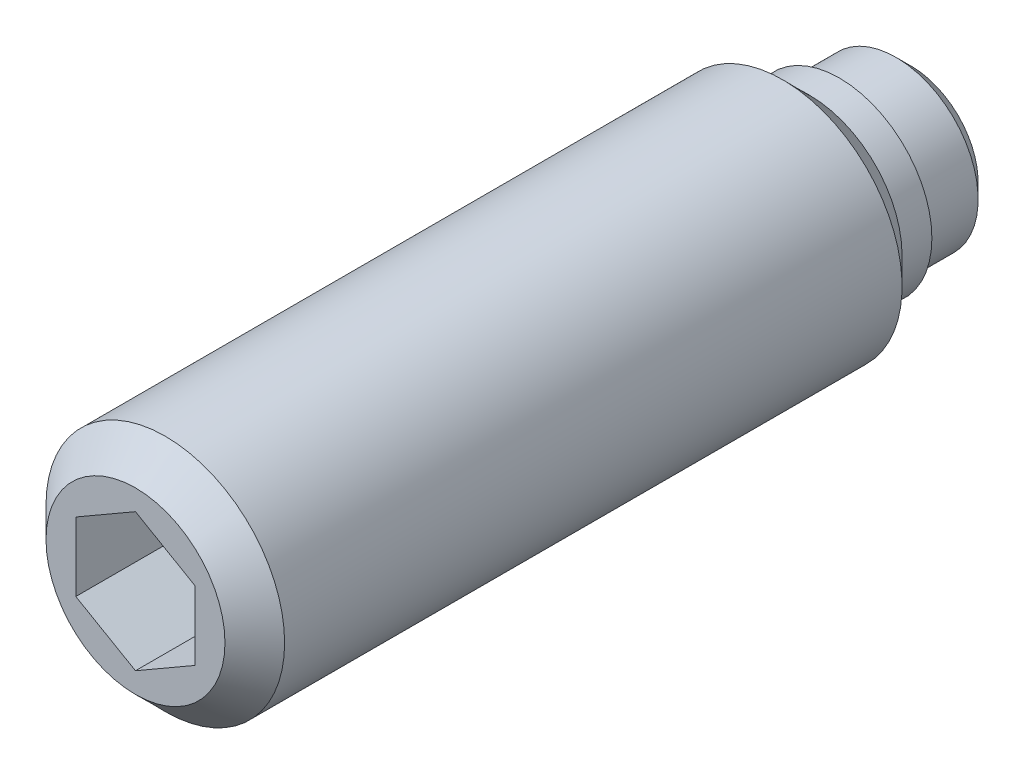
ISO-10303-21;
HEADER;
FILE_DESCRIPTION(('STEP AP214'),'2;1');
FILE_NAME('part.step','',(''),(''),'','','');
FILE_SCHEMA(('AUTOMOTIVE_DESIGN { 1 0 10303 214 1 1 1 1 }'));
ENDSEC;
DATA;
#1=APPLICATION_CONTEXT('core data for automotive mechanical design processes');
#2=APPLICATION_PROTOCOL_DEFINITION('international standard','automotive_design',2000,#1);
#3=PRODUCT_CONTEXT('',#1,'mechanical');
#4=PRODUCT('Part','Part','',(#3));
#5=PRODUCT_RELATED_PRODUCT_CATEGORY('part','',(#4));
#6=PRODUCT_DEFINITION_FORMATION('','',#4);
#7=PRODUCT_DEFINITION_CONTEXT('part definition',#1,'design');
#8=PRODUCT_DEFINITION('design','',#6,#7);
#9=PRODUCT_DEFINITION_SHAPE('','',#8);
#10=(LENGTH_UNIT() NAMED_UNIT(*) SI_UNIT(.MILLI.,.METRE.));
#11=(NAMED_UNIT(*) PLANE_ANGLE_UNIT() SI_UNIT($,.RADIAN.));
#12=(NAMED_UNIT(*) SI_UNIT($,.STERADIAN.) SOLID_ANGLE_UNIT());
#13=UNCERTAINTY_MEASURE_WITH_UNIT(LENGTH_MEASURE(1.E-05),#10,'distance_accuracy_value','');
#14=(GEOMETRIC_REPRESENTATION_CONTEXT(3) GLOBAL_UNCERTAINTY_ASSIGNED_CONTEXT((#13)) GLOBAL_UNIT_ASSIGNED_CONTEXT((#10,
#11,#12)) REPRESENTATION_CONTEXT('',''));
#15=CARTESIAN_POINT('',(0.,0.,0.));
#16=DIRECTION('',(0.,0.,1.));
#17=DIRECTION('',(1.,0.,0.));
#18=AXIS2_PLACEMENT_3D('',#15,#16,#17);
#19=CARTESIAN_POINT('',(0.,0.,2.4));
#20=DIRECTION('',(0.,0.,-1.));
#21=DIRECTION('',(-1.,0.,0.));
#22=AXIS2_PLACEMENT_3D('',#19,#20,#21);
#23=CYLINDRICAL_SURFACE('',#22,4.);
#24=CARTESIAN_POINT('',(0.,0.,25.));
#25=DIRECTION('',(0.,0.,1.));
#26=DIRECTION('',(1.,0.,0.));
#27=AXIS2_PLACEMENT_3D('',#24,#25,#26);
#28=CIRCLE('',#27,4.);
#29=CARTESIAN_POINT('',(4.,0.,25.));
#30=VERTEX_POINT('',#29);
#31=EDGE_CURVE('E9',#30,#30,#28,.F.);
#32=ORIENTED_EDGE('',*,*,#31,.T.);
#33=EDGE_LOOP('',(#32));
#34=FACE_BOUND('',#33,.T.);
#35=CARTESIAN_POINT('',(0.,0.,4.3));
#36=DIRECTION('',(0.,0.,-1.));
#37=DIRECTION('',(-1.,0.,0.));
#38=AXIS2_PLACEMENT_3D('',#35,#36,#37);
#39=CIRCLE('',#38,4.);
#40=CARTESIAN_POINT('',(-4.,0.,4.3));
#41=VERTEX_POINT('',#40);
#42=EDGE_CURVE('E74',#41,#41,#39,.T.);
#43=ORIENTED_EDGE('',*,*,#42,.F.);
#44=EDGE_LOOP('',(#43));
#45=FACE_BOUND('',#44,.T.);
#46=ADVANCED_FACE('F14',(#34,#45),#23,.T.);
#47=CARTESIAN_POINT('',(0.,0.,4.3));
#48=DIRECTION('',(0.,0.,1.));
#49=DIRECTION('',(1.,0.,0.));
#50=AXIS2_PLACEMENT_3D('',#47,#48,#49);
#51=CONICAL_SURFACE('',#50,4.,0.785398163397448);
#52=ORIENTED_EDGE('',*,*,#42,.T.);
#53=EDGE_LOOP('',(#52));
#54=FACE_BOUND('',#53,.T.);
#55=CARTESIAN_POINT('',(0.,0.,3.4));
#56=DIRECTION('',(0.,0.,-1.));
#57=DIRECTION('',(-1.,0.,0.));
#58=AXIS2_PLACEMENT_3D('',#55,#56,#57);
#59=CIRCLE('',#58,3.1);
#60=CARTESIAN_POINT('',(-3.1,0.,3.4));
#61=VERTEX_POINT('',#60);
#62=EDGE_CURVE('E112',#61,#61,#59,.T.);
#63=ORIENTED_EDGE('',*,*,#62,.F.);
#64=EDGE_LOOP('',(#63));
#65=FACE_BOUND('',#64,.T.);
#66=ADVANCED_FACE('F130',(#54,#65),#51,.T.);
#67=CARTESIAN_POINT('',(0.,0.,2.4));
#68=DIRECTION('',(0.,0.,-1.));
#69=DIRECTION('',(-1.,0.,0.));
#70=AXIS2_PLACEMENT_3D('',#67,#68,#69);
#71=CYLINDRICAL_SURFACE('',#70,3.1);
#72=ORIENTED_EDGE('',*,*,#62,.T.);
#73=EDGE_LOOP('',(#72));
#74=FACE_BOUND('',#73,.T.);
#75=CARTESIAN_POINT('',(0.,0.,2.4));
#76=DIRECTION('',(0.,0.,-1.));
#77=DIRECTION('',(-1.,0.,0.));
#78=AXIS2_PLACEMENT_3D('',#75,#76,#77);
#79=CIRCLE('',#78,3.1);
#80=CARTESIAN_POINT('',(-3.1,0.,2.4));
#81=VERTEX_POINT('',#80);
#82=EDGE_CURVE('E109',#81,#81,#79,.T.);
#83=ORIENTED_EDGE('',*,*,#82,.F.);
#84=EDGE_LOOP('',(#83));
#85=FACE_BOUND('',#84,.T.);
#86=ADVANCED_FACE('F135',(#74,#85),#71,.T.);
#87=CARTESIAN_POINT('',(0.,3.1,2.4));
#88=DIRECTION('',(0.,0.,1.));
#89=DIRECTION('',(1.,0.,0.));
#90=AXIS2_PLACEMENT_3D('',#87,#88,#89);
#91=PLANE('',#90);
#92=ORIENTED_EDGE('',*,*,#82,.T.);
#93=EDGE_LOOP('',(#92));
#94=FACE_BOUND('',#93,.T.);
#95=CARTESIAN_POINT('',(0.,0.,2.4));
#96=DIRECTION('',(0.,0.,-1.));
#97=DIRECTION('',(-1.,0.,0.));
#98=AXIS2_PLACEMENT_3D('',#95,#96,#97);
#99=CIRCLE('',#98,2.75);
#100=CARTESIAN_POINT('',(-2.75,0.,2.4));
#101=VERTEX_POINT('',#100);
#102=EDGE_CURVE('E106',#101,#101,#99,.T.);
#103=ORIENTED_EDGE('',*,*,#102,.F.);
#104=EDGE_LOOP('',(#103));
#105=FACE_BOUND('',#104,.T.);
#106=ADVANCED_FACE('F142',(#94,#105),#91,.F.);
#107=CARTESIAN_POINT('',(0.,0.,0.));
#108=DIRECTION('',(0.,0.,-1.));
#109=DIRECTION('',(-1.,0.,0.));
#110=AXIS2_PLACEMENT_3D('',#107,#108,#109);
#111=CYLINDRICAL_SURFACE('',#110,2.75);
#112=CARTESIAN_POINT('',(0.,0.,0.5));
#113=DIRECTION('',(0.,0.,-1.));
#114=DIRECTION('',(-1.,0.,0.));
#115=AXIS2_PLACEMENT_3D('',#112,#113,#114);
#116=CIRCLE('',#115,2.75);
#117=CARTESIAN_POINT('',(-2.75,0.,0.5));
#118=VERTEX_POINT('',#117);
#119=EDGE_CURVE('E103',#118,#118,#116,.T.);
#120=ORIENTED_EDGE('',*,*,#119,.F.);
#121=EDGE_LOOP('',(#120));
#122=FACE_BOUND('',#121,.T.);
#123=ORIENTED_EDGE('',*,*,#102,.T.);
#124=EDGE_LOOP('',(#123));
#125=FACE_BOUND('',#124,.T.);
#126=ADVANCED_FACE('F146',(#122,#125),#111,.T.);
#127=CARTESIAN_POINT('',(0.,0.,0.5));
#128=DIRECTION('',(0.,0.,1.));
#129=DIRECTION('',(1.,0.,0.));
#130=AXIS2_PLACEMENT_3D('',#127,#128,#129);
#131=CONICAL_SURFACE('',#130,2.75,0.785398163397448);
#132=CARTESIAN_POINT('',(0.,0.,0.));
#133=DIRECTION('',(0.,0.,-1.));
#134=DIRECTION('',(-1.,0.,0.));
#135=AXIS2_PLACEMENT_3D('',#132,#133,#134);
#136=CIRCLE('',#135,2.25);
#137=CARTESIAN_POINT('',(-2.25,0.,0.));
#138=VERTEX_POINT('',#137);
#139=EDGE_CURVE('E100',#138,#138,#136,.T.);
#140=ORIENTED_EDGE('',*,*,#139,.F.);
#141=EDGE_LOOP('',(#140));
#142=FACE_BOUND('',#141,.T.);
#143=ORIENTED_EDGE('',*,*,#119,.T.);
#144=EDGE_LOOP('',(#143));
#145=FACE_BOUND('',#144,.T.);
#146=ADVANCED_FACE('F150',(#142,#145),#131,.T.);
#147=CARTESIAN_POINT('',(0.,2.25,0.));
#148=DIRECTION('',(0.,0.,1.));
#149=DIRECTION('',(1.,0.,0.));
#150=AXIS2_PLACEMENT_3D('',#147,#148,#149);
#151=PLANE('',#150);
#152=ORIENTED_EDGE('',*,*,#139,.T.);
#153=EDGE_LOOP('',(#152));
#154=FACE_BOUND('',#153,.T.);
#155=ADVANCED_FACE('F154',(#154),#151,.F.);
#156=CARTESIAN_POINT('',(0.,0.,26.));
#157=DIRECTION('',(0.,0.,1.));
#158=DIRECTION('',(1.,0.,0.));
#159=AXIS2_PLACEMENT_3D('',#156,#157,#158);
#160=PLANE('',#159);
#161=CARTESIAN_POINT('',(0.,0.,26.));
#162=DIRECTION('',(0.,0.,1.));
#163=DIRECTION('',(1.,0.,0.));
#164=AXIS2_PLACEMENT_3D('',#161,#162,#163);
#165=CIRCLE('',#164,3.);
#166=CARTESIAN_POINT('',(3.,0.,26.));
#167=VERTEX_POINT('',#166);
#168=EDGE_CURVE('E22',#167,#167,#165,.T.);
#169=ORIENTED_EDGE('',*,*,#168,.T.);
#170=EDGE_LOOP('',(#169));
#171=FACE_BOUND('',#170,.T.);
#172=DIRECTION('',(-0.866025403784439,0.5,0.));
#173=VECTOR('',#172,1.);
#174=CARTESIAN_POINT('',(-2.,-1.15470053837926,26.));
#175=LINE('',#174,#173);
#176=CARTESIAN_POINT('',(0.,-2.30940107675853,26.));
#177=VERTEX_POINT('',#176);
#178=CARTESIAN_POINT('',(-2.,-1.15470053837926,26.));
#179=VERTEX_POINT('',#178);
#180=EDGE_CURVE('E69',#177,#179,#175,.T.);
#181=ORIENTED_EDGE('',*,*,#180,.T.);
#182=DIRECTION('',(0.,1.,0.));
#183=VECTOR('',#182,1.);
#184=CARTESIAN_POINT('',(-2.,1.15470053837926,26.));
#185=LINE('',#184,#183);
#186=CARTESIAN_POINT('',(-2.,1.15470053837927,26.));
#187=VERTEX_POINT('',#186);
#188=EDGE_CURVE('E84',#179,#187,#185,.T.);
#189=ORIENTED_EDGE('',*,*,#188,.T.);
#190=DIRECTION('',(0.866025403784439,0.5,0.));
#191=VECTOR('',#190,1.);
#192=CARTESIAN_POINT('',(0.,2.30940107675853,26.));
#193=LINE('',#192,#191);
#194=CARTESIAN_POINT('',(0.,2.30940107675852,26.));
#195=VERTEX_POINT('',#194);
#196=EDGE_CURVE('E300',#187,#195,#193,.T.);
#197=ORIENTED_EDGE('',*,*,#196,.T.);
#198=DIRECTION('',(0.866025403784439,-0.5,0.));
#199=VECTOR('',#198,1.);
#200=CARTESIAN_POINT('',(2.,1.15470053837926,26.));
#201=LINE('',#200,#199);
#202=CARTESIAN_POINT('',(2.,1.15470053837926,26.));
#203=VERTEX_POINT('',#202);
#204=EDGE_CURVE('E297',#195,#203,#201,.T.);
#205=ORIENTED_EDGE('',*,*,#204,.T.);
#206=DIRECTION('',(0.,-1.,0.));
#207=VECTOR('',#206,1.);
#208=CARTESIAN_POINT('',(2.,-1.15470053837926,26.));
#209=LINE('',#208,#207);
#210=CARTESIAN_POINT('',(2.,-1.15470053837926,26.));
#211=VERTEX_POINT('',#210);
#212=EDGE_CURVE('E29',#203,#211,#209,.T.);
#213=ORIENTED_EDGE('',*,*,#212,.T.);
#214=DIRECTION('',(-0.866025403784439,-0.5,0.));
#215=VECTOR('',#214,1.);
#216=CARTESIAN_POINT('',(0.,-2.30940107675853,26.));
#217=LINE('',#216,#215);
#218=EDGE_CURVE('E66',#211,#177,#217,.T.);
#219=ORIENTED_EDGE('',*,*,#218,.T.);
#220=EDGE_LOOP('',(#181,#189,#197,#205,#213,#219));
#221=FACE_BOUND('',#220,.T.);
#222=ADVANCED_FACE('F68',(#171,#221),#160,.T.);
#223=CARTESIAN_POINT('',(0.,0.,21.));
#224=DIRECTION('',(0.,0.,1.));
#225=DIRECTION('',(1.,0.,0.));
#226=AXIS2_PLACEMENT_3D('',#223,#224,#225);
#227=PLANE('',#226);
#228=DIRECTION('',(-0.866025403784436,-0.5,0.));
#229=VECTOR('',#228,1.);
#230=CARTESIAN_POINT('',(0.,2.30940107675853,21.));
#231=LINE('',#230,#229);
#232=CARTESIAN_POINT('',(0.,2.30940107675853,21.));
#233=VERTEX_POINT('',#232);
#234=CARTESIAN_POINT('',(-2.,1.15470053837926,21.));
#235=VERTEX_POINT('',#234);
#236=EDGE_CURVE('E83',#233,#235,#231,.T.);
#237=ORIENTED_EDGE('',*,*,#236,.T.);
#238=DIRECTION('',(0.,-1.,0.));
#239=VECTOR('',#238,1.);
#240=CARTESIAN_POINT('',(-2.,1.15470053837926,21.));
#241=LINE('',#240,#239);
#242=CARTESIAN_POINT('',(-2.,-1.15470053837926,21.));
#243=VERTEX_POINT('',#242);
#244=EDGE_CURVE('E282',#235,#243,#241,.T.);
#245=ORIENTED_EDGE('',*,*,#244,.T.);
#246=DIRECTION('',(0.866025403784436,-0.5,0.));
#247=VECTOR('',#246,1.);
#248=CARTESIAN_POINT('',(-2.,-1.15470053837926,21.));
#249=LINE('',#248,#247);
#250=CARTESIAN_POINT('',(0.,-2.30940107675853,21.));
#251=VERTEX_POINT('',#250);
#252=EDGE_CURVE('E285',#243,#251,#249,.T.);
#253=ORIENTED_EDGE('',*,*,#252,.T.);
#254=DIRECTION('',(0.866025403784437,0.5,0.));
#255=VECTOR('',#254,1.);
#256=CARTESIAN_POINT('',(0.,-2.30940107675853,21.));
#257=LINE('',#256,#255);
#258=CARTESIAN_POINT('',(2.,-1.15470053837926,21.));
#259=VERTEX_POINT('',#258);
#260=EDGE_CURVE('E88',#251,#259,#257,.T.);
#261=ORIENTED_EDGE('',*,*,#260,.T.);
#262=DIRECTION('',(0.,1.,0.));
#263=VECTOR('',#262,1.);
#264=CARTESIAN_POINT('',(2.,-1.15470053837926,21.));
#265=LINE('',#264,#263);
#266=CARTESIAN_POINT('',(2.,1.15470053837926,21.));
#267=VERTEX_POINT('',#266);
#268=EDGE_CURVE('E96',#259,#267,#265,.T.);
#269=ORIENTED_EDGE('',*,*,#268,.T.);
#270=DIRECTION('',(-0.866025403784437,0.5,0.));
#271=VECTOR('',#270,1.);
#272=CARTESIAN_POINT('',(2.,1.15470053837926,21.));
#273=LINE('',#272,#271);
#274=EDGE_CURVE('E91',#267,#233,#273,.T.);
#275=ORIENTED_EDGE('',*,*,#274,.T.);
#276=EDGE_LOOP('',(#237,#245,#253,#261,#269,#275));
#277=FACE_BOUND('',#276,.T.);
#278=ADVANCED_FACE('F162',(#277),#227,.T.);
#279=CARTESIAN_POINT('',(0.,-2.30940107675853,29.));
#280=DIRECTION('',(0.5,-0.866025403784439,0.));
#281=DIRECTION('',(0.866025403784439,0.5,0.));
#282=AXIS2_PLACEMENT_3D('',#279,#280,#281);
#283=PLANE('',#282);
#284=ORIENTED_EDGE('',*,*,#218,.F.);
#285=DIRECTION('',(0.,0.,1.));
#286=VECTOR('',#285,1.);
#287=CARTESIAN_POINT('',(2.,-1.15470053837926,29.));
#288=LINE('',#287,#286);
#289=EDGE_CURVE('E90',#259,#211,#288,.T.);
#290=ORIENTED_EDGE('',*,*,#289,.F.);
#291=ORIENTED_EDGE('',*,*,#260,.F.);
#292=DIRECTION('',(0.,0.,1.));
#293=VECTOR('',#292,1.);
#294=CARTESIAN_POINT('',(0.,-2.30940107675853,29.));
#295=LINE('',#294,#293);
#296=EDGE_CURVE('E80',#251,#177,#295,.T.);
#297=ORIENTED_EDGE('',*,*,#296,.T.);
#298=EDGE_LOOP('',(#284,#290,#291,#297));
#299=FACE_BOUND('',#298,.T.);
#300=ADVANCED_FACE('F86',(#299),#283,.F.);
#301=CARTESIAN_POINT('',(2.,-1.15470053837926,29.));
#302=DIRECTION('',(1.,0.,0.));
#303=DIRECTION('',(0.,0.,-1.));
#304=AXIS2_PLACEMENT_3D('',#301,#302,#303);
#305=PLANE('',#304);
#306=ORIENTED_EDGE('',*,*,#212,.F.);
#307=DIRECTION('',(0.,0.,1.));
#308=VECTOR('',#307,1.);
#309=CARTESIAN_POINT('',(2.,1.15470053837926,29.));
#310=LINE('',#309,#308);
#311=EDGE_CURVE('E93',#267,#203,#310,.T.);
#312=ORIENTED_EDGE('',*,*,#311,.F.);
#313=ORIENTED_EDGE('',*,*,#268,.F.);
#314=ORIENTED_EDGE('',*,*,#289,.T.);
#315=EDGE_LOOP('',(#306,#312,#313,#314));
#316=FACE_BOUND('',#315,.T.);
#317=ADVANCED_FACE('F161',(#316),#305,.F.);
#318=CARTESIAN_POINT('',(2.,1.15470053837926,29.));
#319=DIRECTION('',(0.5,0.866025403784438,0.));
#320=DIRECTION('',(-0.866025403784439,0.5,0.));
#321=AXIS2_PLACEMENT_3D('',#318,#319,#320);
#322=PLANE('',#321);
#323=ORIENTED_EDGE('',*,*,#204,.F.);
#324=DIRECTION('',(0.,0.,1.));
#325=VECTOR('',#324,1.);
#326=CARTESIAN_POINT('',(0.,2.30940107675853,29.));
#327=LINE('',#326,#325);
#328=EDGE_CURVE('E37',#233,#195,#327,.T.);
#329=ORIENTED_EDGE('',*,*,#328,.F.);
#330=ORIENTED_EDGE('',*,*,#274,.F.);
#331=ORIENTED_EDGE('',*,*,#311,.T.);
#332=EDGE_LOOP('',(#323,#329,#330,#331));
#333=FACE_BOUND('',#332,.T.);
#334=ADVANCED_FACE('F165',(#333),#322,.F.);
#335=CARTESIAN_POINT('',(0.,2.30940107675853,29.));
#336=DIRECTION('',(-0.5,0.866025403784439,0.));
#337=DIRECTION('',(-0.866025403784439,-0.5,0.));
#338=AXIS2_PLACEMENT_3D('',#335,#336,#337);
#339=PLANE('',#338);
#340=ORIENTED_EDGE('',*,*,#196,.F.);
#341=DIRECTION('',(0.,0.,1.));
#342=VECTOR('',#341,1.);
#343=CARTESIAN_POINT('',(-2.,1.15470053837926,29.));
#344=LINE('',#343,#342);
#345=EDGE_CURVE('E293',#235,#187,#344,.T.);
#346=ORIENTED_EDGE('',*,*,#345,.F.);
#347=ORIENTED_EDGE('',*,*,#236,.F.);
#348=ORIENTED_EDGE('',*,*,#328,.T.);
#349=EDGE_LOOP('',(#340,#346,#347,#348));
#350=FACE_BOUND('',#349,.T.);
#351=ADVANCED_FACE('F169',(#350),#339,.F.);
#352=CARTESIAN_POINT('',(-2.,1.15470053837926,29.));
#353=DIRECTION('',(-1.,0.,0.));
#354=DIRECTION('',(0.,0.,1.));
#355=AXIS2_PLACEMENT_3D('',#352,#353,#354);
#356=PLANE('',#355);
#357=ORIENTED_EDGE('',*,*,#188,.F.);
#358=DIRECTION('',(0.,0.,1.));
#359=VECTOR('',#358,1.);
#360=CARTESIAN_POINT('',(-2.,-1.15470053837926,29.));
#361=LINE('',#360,#359);
#362=EDGE_CURVE('E82',#243,#179,#361,.T.);
#363=ORIENTED_EDGE('',*,*,#362,.F.);
#364=ORIENTED_EDGE('',*,*,#244,.F.);
#365=ORIENTED_EDGE('',*,*,#345,.T.);
#366=EDGE_LOOP('',(#357,#363,#364,#365));
#367=FACE_BOUND('',#366,.T.);
#368=ADVANCED_FACE('F126',(#367),#356,.F.);
#369=CARTESIAN_POINT('',(-2.,-1.15470053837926,29.));
#370=DIRECTION('',(-0.5,-0.866025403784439,0.));
#371=DIRECTION('',(0.866025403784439,-0.5,0.));
#372=AXIS2_PLACEMENT_3D('',#369,#370,#371);
#373=PLANE('',#372);
#374=ORIENTED_EDGE('',*,*,#180,.F.);
#375=ORIENTED_EDGE('',*,*,#296,.F.);
#376=ORIENTED_EDGE('',*,*,#252,.F.);
#377=ORIENTED_EDGE('',*,*,#362,.T.);
#378=EDGE_LOOP('',(#374,#375,#376,#377));
#379=FACE_BOUND('',#378,.T.);
#380=ADVANCED_FACE('F78',(#379),#373,.F.);
#381=CARTESIAN_POINT('',(0.,0.,26.));
#382=DIRECTION('',(0.,0.,-1.));
#383=DIRECTION('',(-1.,0.,0.));
#384=AXIS2_PLACEMENT_3D('',#381,#382,#383);
#385=CONICAL_SURFACE('',#384,3.,0.785398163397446);
#386=ORIENTED_EDGE('',*,*,#31,.F.);
#387=EDGE_LOOP('',(#386));
#388=FACE_BOUND('',#387,.T.);
#389=ORIENTED_EDGE('',*,*,#168,.F.);
#390=EDGE_LOOP('',(#389));
#391=FACE_BOUND('',#390,.T.);
#392=ADVANCED_FACE('F16',(#388,#391),#385,.T.);
#393=CLOSED_SHELL('',(#46,#66,#86,#106,#126,#146,#155,#222,#278,#300,#317,#334,#351,#368,#380,#392));
#394=MANIFOLD_SOLID_BREP('B1',#393);
#395=ADVANCED_BREP_SHAPE_REPRESENTATION('',(#18,#394),#14);
#396=SHAPE_DEFINITION_REPRESENTATION(#9,#395);
ENDSEC;
END-ISO-10303-21;
